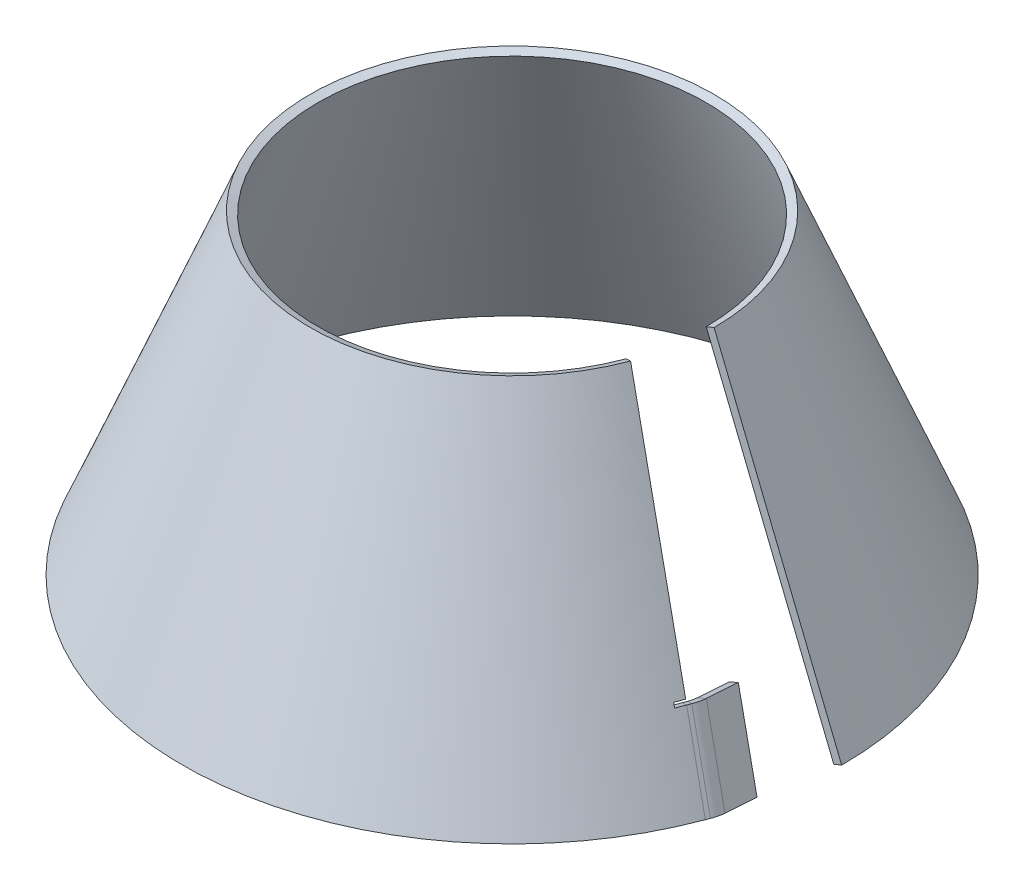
ISO-10303-21;
HEADER;
FILE_DESCRIPTION(('STEP AP214'),'2;1');
FILE_NAME('part.step','',(''),(''),'','','');
FILE_SCHEMA(('AUTOMOTIVE_DESIGN { 1 0 10303 214 1 1 1 1 }'));
ENDSEC;
DATA;
#1=APPLICATION_CONTEXT('core data for automotive mechanical design processes');
#2=APPLICATION_PROTOCOL_DEFINITION('international standard','automotive_design',2000,#1);
#3=PRODUCT_CONTEXT('',#1,'mechanical');
#4=PRODUCT('Part','Part','',(#3));
#5=PRODUCT_RELATED_PRODUCT_CATEGORY('part','',(#4));
#6=PRODUCT_DEFINITION_FORMATION('','',#4);
#7=PRODUCT_DEFINITION_CONTEXT('part definition',#1,'design');
#8=PRODUCT_DEFINITION('design','',#6,#7);
#9=PRODUCT_DEFINITION_SHAPE('','',#8);
#10=(LENGTH_UNIT() NAMED_UNIT(*) SI_UNIT(.MILLI.,.METRE.));
#11=(NAMED_UNIT(*) PLANE_ANGLE_UNIT() SI_UNIT($,.RADIAN.));
#12=(NAMED_UNIT(*) SI_UNIT($,.STERADIAN.) SOLID_ANGLE_UNIT());
#13=UNCERTAINTY_MEASURE_WITH_UNIT(LENGTH_MEASURE(1.E-05),#10,'distance_accuracy_value','');
#14=(GEOMETRIC_REPRESENTATION_CONTEXT(3) GLOBAL_UNCERTAINTY_ASSIGNED_CONTEXT((#13)) GLOBAL_UNIT_ASSIGNED_CONTEXT((#10,
#11,#12)) REPRESENTATION_CONTEXT('',''));
#15=CARTESIAN_POINT('',(0.,0.,0.));
#16=DIRECTION('',(0.,0.,1.));
#17=DIRECTION('',(1.,0.,0.));
#18=AXIS2_PLACEMENT_3D('',#15,#16,#17);
#19=CARTESIAN_POINT('',(5.90430412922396,-0.670239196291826,11.3082897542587));
#20=DIRECTION('',(0.13084470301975,0.187568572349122,0.973497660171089));
#21=DIRECTION('',(0.562327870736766,-0.822744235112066,0.0829414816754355));
#22=AXIS2_PLACEMENT_3D('',#19,#20,#21);
#23=PLANE('',#22);
#24=DIRECTION('',(0.92704443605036,0.324878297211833,-0.187196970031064));
#25=VECTOR('',#24,1.);
#26=CARTESIAN_POINT('',(5.90430412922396,-0.670239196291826,11.3082897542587));
#27=LINE('',#26,#25);
#28=CARTESIAN_POINT('',(31.5918834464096,8.33185035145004,6.12122770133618));
#29=VERTEX_POINT('',#28);
#30=CARTESIAN_POINT('',(32.51892788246,8.65672864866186,5.93403073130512));
#31=VERTEX_POINT('',#30);
#32=EDGE_CURVE('E282',#29,#31,#27,.T.);
#33=ORIENTED_EDGE('',*,*,#32,.T.);
#34=DIRECTION('',(0.351380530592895,-0.926969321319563,0.131375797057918));
#35=VECTOR('',#34,1.);
#36=CARTESIAN_POINT('',(32.51892788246,8.65672864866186,5.93403073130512));
#37=LINE('',#36,#35);
#38=CARTESIAN_POINT('',(36.032733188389,-0.612964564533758,7.2477887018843));
#39=VERTEX_POINT('',#38);
#40=EDGE_CURVE('E281',#31,#39,#37,.T.);
#41=ORIENTED_EDGE('',*,*,#40,.T.);
#42=DIRECTION('',(0.92704443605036,0.324878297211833,-0.187196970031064));
#43=VECTOR('',#42,1.);
#44=CARTESIAN_POINT('',(9.41810943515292,-9.93993240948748,12.6220477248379));
#45=LINE('',#44,#43);
#46=CARTESIAN_POINT('',(35.1056887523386,-0.937842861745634,7.43498567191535));
#47=VERTEX_POINT('',#46);
#48=EDGE_CURVE('E265',#47,#39,#45,.T.);
#49=ORIENTED_EDGE('',*,*,#48,.F.);
#50=DIRECTION('',(0.351380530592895,-0.926969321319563,0.131375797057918));
#51=VECTOR('',#50,1.);
#52=CARTESIAN_POINT('',(31.5918834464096,8.33185035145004,6.12122770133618));
#53=LINE('',#52,#51);
#54=EDGE_CURVE('E14',#29,#47,#53,.T.);
#55=ORIENTED_EDGE('',*,*,#54,.F.);
#56=EDGE_LOOP('',(#33,#41,#49,#55));
#57=FACE_BOUND('',#56,.T.);
#58=ADVANCED_FACE('F64',(#57),#23,.F.);
#59=CARTESIAN_POINT('',(6.55852764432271,0.267603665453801,16.1757780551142));
#60=DIRECTION('',(-0.351380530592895,0.926969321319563,-0.131375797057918));
#61=DIRECTION('',(-0.159317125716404,0.0790750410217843,0.984055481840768));
#62=AXIS2_PLACEMENT_3D('',#59,#60,#61);
#63=PLANE('',#62);
#64=DIRECTION('',(-0.130844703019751,-0.187568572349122,-0.973497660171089));
#65=VECTOR('',#64,1.);
#66=CARTESIAN_POINT('',(33.2082111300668,9.64483035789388,11.062366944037));
#67=LINE('',#66,#65);
#68=CARTESIAN_POINT('',(33.1030319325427,9.49405381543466,10.2798232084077));
#69=VERTEX_POINT('',#68);
#70=EDGE_CURVE('E278',#69,#31,#67,.T.);
#71=ORIENTED_EDGE('',*,*,#70,.T.);
#72=ORIENTED_EDGE('',*,*,#32,.F.);
#73=DIRECTION('',(0.13084470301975,0.187568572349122,0.973497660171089));
#74=VECTOR('',#73,1.);
#75=CARTESIAN_POINT('',(32.2461069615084,9.26969321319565,10.9887160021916));
#76=LINE('',#75,#74);
#77=CARTESIAN_POINT('',(32.1759874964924,9.16917551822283,10.4670201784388));
#78=VERTEX_POINT('',#77);
#79=EDGE_CURVE('E275',#29,#78,#76,.T.);
#80=ORIENTED_EDGE('',*,*,#79,.T.);
#81=DIRECTION('',(0.92704443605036,0.324878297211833,-0.187196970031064));
#82=VECTOR('',#81,1.);
#83=CARTESIAN_POINT('',(6.48840817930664,0.167085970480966,15.6540822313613));
#84=LINE('',#83,#82);
#85=EDGE_CURVE('E200',#78,#69,#84,.T.);
#86=ORIENTED_EDGE('',*,*,#85,.T.);
#87=EDGE_LOOP('',(#71,#72,#80,#86));
#88=FACE_BOUND('',#87,.T.);
#89=ADVANCED_FACE('F250',(#88),#63,.T.);
#90=CARTESIAN_POINT('',(33.2082111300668,9.64483035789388,11.062366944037));
#91=DIRECTION('',(-0.927044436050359,-0.324878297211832,0.187196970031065));
#92=DIRECTION('',(0.330724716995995,-0.943727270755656,0.));
#93=AXIS2_PLACEMENT_3D('',#90,#91,#92);
#94=PLANE('',#93);
#95=ORIENTED_EDGE('',*,*,#70,.F.);
#96=DIRECTION('',(0.351380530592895,-0.926969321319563,0.13137579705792));
#97=VECTOR('',#96,1.);
#98=CARTESIAN_POINT('',(33.1030319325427,9.49405381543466,10.2798232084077));
#99=LINE('',#98,#97);
#100=CARTESIAN_POINT('',(36.6168372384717,0.224360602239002,11.5935811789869));
#101=VERTEX_POINT('',#100);
#102=EDGE_CURVE('E268',#69,#101,#99,.T.);
#103=ORIENTED_EDGE('',*,*,#102,.T.);
#104=DIRECTION('',(0.130844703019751,0.187568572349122,0.973497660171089));
#105=VECTOR('',#104,1.);
#106=CARTESIAN_POINT('',(36.6869567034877,0.324878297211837,12.1152770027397));
#107=LINE('',#106,#105);
#108=EDGE_CURVE('E95',#39,#101,#107,.T.);
#109=ORIENTED_EDGE('',*,*,#108,.F.);
#110=ORIENTED_EDGE('',*,*,#40,.F.);
#111=EDGE_LOOP('',(#95,#103,#109,#110));
#112=FACE_BOUND('',#111,.T.);
#113=ADVANCED_FACE('F254',(#112),#94,.F.);
#114=CARTESIAN_POINT('',(10.0723329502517,-9.00208954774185,17.4895360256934));
#115=DIRECTION('',(-0.351380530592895,0.926969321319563,-0.131375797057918));
#116=DIRECTION('',(-0.159317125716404,0.0790750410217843,0.984055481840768));
#117=AXIS2_PLACEMENT_3D('',#114,#115,#116);
#118=PLANE('',#117);
#119=ORIENTED_EDGE('',*,*,#48,.T.);
#120=ORIENTED_EDGE('',*,*,#108,.T.);
#121=DIRECTION('',(0.92704443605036,0.324878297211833,-0.187196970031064));
#122=VECTOR('',#121,1.);
#123=CARTESIAN_POINT('',(10.0022134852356,-9.10260724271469,16.9678402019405));
#124=LINE('',#123,#122);
#125=CARTESIAN_POINT('',(35.6897928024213,-0.100517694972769,11.780778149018));
#126=VERTEX_POINT('',#125);
#127=EDGE_CURVE('E68',#126,#101,#124,.T.);
#128=ORIENTED_EDGE('',*,*,#127,.F.);
#129=DIRECTION('',(0.13084470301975,0.187568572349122,0.973497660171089));
#130=VECTOR('',#129,1.);
#131=CARTESIAN_POINT('',(35.7599122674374,0.,12.3024739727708));
#132=LINE('',#131,#130);
#133=EDGE_CURVE('E267',#47,#126,#132,.T.);
#134=ORIENTED_EDGE('',*,*,#133,.F.);
#135=EDGE_LOOP('',(#119,#120,#128,#134));
#136=FACE_BOUND('',#135,.T.);
#137=ADVANCED_FACE('F257',(#136),#118,.F.);
#138=CARTESIAN_POINT('',(32.2461069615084,9.26969321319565,10.9887160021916));
#139=DIRECTION('',(0.927044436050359,0.324878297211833,-0.187196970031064));
#140=DIRECTION('',(-0.330724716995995,0.943727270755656,0.));
#141=AXIS2_PLACEMENT_3D('',#138,#139,#140);
#142=PLANE('',#141);
#143=ORIENTED_EDGE('',*,*,#133,.T.);
#144=DIRECTION('',(-0.351380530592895,0.926969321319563,-0.13137579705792));
#145=VECTOR('',#144,1.);
#146=CARTESIAN_POINT('',(32.1759874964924,9.16917551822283,10.4670201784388));
#147=LINE('',#146,#145);
#148=EDGE_CURVE('E74',#126,#78,#147,.T.);
#149=ORIENTED_EDGE('',*,*,#148,.T.);
#150=ORIENTED_EDGE('',*,*,#79,.F.);
#151=ORIENTED_EDGE('',*,*,#54,.T.);
#152=EDGE_LOOP('',(#143,#149,#150,#151));
#153=FACE_BOUND('',#152,.T.);
#154=ADVANCED_FACE('F66',(#153),#142,.F.);
#155=CARTESIAN_POINT('',(14.6201641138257,1.80565890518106,5.46625537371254));
#156=DIRECTION('',(-0.351380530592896,0.926969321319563,-0.131375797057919));
#157=DIRECTION('',(-0.599261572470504,-0.114873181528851,0.792268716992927));
#158=AXIS2_PLACEMENT_3D('',#155,#156,#157);
#159=PLANE('',#158);
#160=DIRECTION('',(0.350207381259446,0.,-0.936672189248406));
#161=VECTOR('',#160,1.);
#162=CARTESIAN_POINT('',(32.7641659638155,9.6448303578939,12.2500196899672));
#163=LINE('',#162,#161);
#164=CARTESIAN_POINT('',(32.7641659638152,9.64483035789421,12.2500196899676));
#165=VERTEX_POINT('',#164);
#166=CARTESIAN_POINT('',(32.9266977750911,9.64483035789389,11.8153086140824));
#167=VERTEX_POINT('',#166);
#168=EDGE_CURVE('E185',#165,#167,#163,.T.);
#169=ORIENTED_EDGE('',*,*,#168,.T.);
#170=DIRECTION('',(0.868266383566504,0.37513714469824,0.32463149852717));
#171=VECTOR('',#170,1.);
#172=CARTESIAN_POINT('',(14.7826959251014,1.80565890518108,5.03154429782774));
#173=LINE('',#172,#171);
#174=CARTESIAN_POINT('',(32.0584313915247,9.26969321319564,11.4906771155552));
#175=VERTEX_POINT('',#174);
#176=EDGE_CURVE('E180',#175,#167,#173,.T.);
#177=ORIENTED_EDGE('',*,*,#176,.F.);
#178=DIRECTION('',(-0.350207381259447,0.,0.936672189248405));
#179=VECTOR('',#178,1.);
#180=CARTESIAN_POINT('',(31.895899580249,9.26969321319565,11.92538819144));
#181=LINE('',#180,#179);
#182=CARTESIAN_POINT('',(31.895899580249,9.26969321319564,11.92538819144));
#183=VERTEX_POINT('',#182);
#184=EDGE_CURVE('E183',#175,#183,#181,.T.);
#185=ORIENTED_EDGE('',*,*,#184,.T.);
#186=CARTESIAN_POINT('',(32.7641659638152,9.64483035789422,12.2500196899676));
#187=CARTESIAN_POINT('',(31.8958995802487,9.26969321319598,11.9253881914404));
#188=B_SPLINE_CURVE_WITH_KNOTS('',1,(#186,#187),.UNSPECIFIED.,.F.,.F.,(2,2),(0.,1.),.UNSPECIFIED.);
#189=EDGE_CURVE('E208',#183,#165,#188,.F.);
#190=ORIENTED_EDGE('',*,*,#189,.T.);
#191=EDGE_LOOP('',(#169,#177,#185,#190));
#192=FACE_BOUND('',#191,.T.);
#193=ADVANCED_FACE('F181',(#192),#159,.T.);
#194=CARTESIAN_POINT('',(18.1339694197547,-7.46403430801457,6.78001334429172));
#195=DIRECTION('',(-0.351380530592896,0.926969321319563,-0.131375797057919));
#196=DIRECTION('',(-0.599261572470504,-0.114873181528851,0.792268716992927));
#197=AXIS2_PLACEMENT_3D('',#194,#195,#196);
#198=PLANE('',#197);
#199=DIRECTION('',(0.868266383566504,0.37513714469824,0.32463149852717));
#200=VECTOR('',#199,1.);
#201=CARTESIAN_POINT('',(18.2965012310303,-7.46403430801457,6.34530226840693));
#202=LINE('',#201,#200);
#203=CARTESIAN_POINT('',(35.5722366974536,0.,12.8044350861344));
#204=VERTEX_POINT('',#203);
#205=CARTESIAN_POINT('',(36.4405030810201,0.375137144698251,13.1290665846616));
#206=VERTEX_POINT('',#205);
#207=EDGE_CURVE('E190',#204,#206,#202,.T.);
#208=ORIENTED_EDGE('',*,*,#207,.T.);
#209=DIRECTION('',(0.350207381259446,0.,-0.936672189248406));
#210=VECTOR('',#209,1.);
#211=CARTESIAN_POINT('',(36.2779712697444,0.375137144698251,13.5637776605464));
#212=LINE('',#211,#210);
#213=CARTESIAN_POINT('',(36.2779712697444,0.375137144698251,13.5637776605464));
#214=VERTEX_POINT('',#213);
#215=EDGE_CURVE('E224',#214,#206,#212,.T.);
#216=ORIENTED_EDGE('',*,*,#215,.F.);
#217=DIRECTION('',(0.868266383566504,0.37513714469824,0.32463149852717));
#218=VECTOR('',#217,1.);
#219=CARTESIAN_POINT('',(18.1339694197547,-7.46403430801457,6.78001334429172));
#220=LINE('',#219,#218);
#221=CARTESIAN_POINT('',(35.4097048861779,0.,13.2391461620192));
#222=VERTEX_POINT('',#221);
#223=EDGE_CURVE('E210',#222,#214,#220,.T.);
#224=ORIENTED_EDGE('',*,*,#223,.F.);
#225=DIRECTION('',(-0.350207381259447,0.,0.936672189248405));
#226=VECTOR('',#225,1.);
#227=CARTESIAN_POINT('',(35.4097048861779,0.,13.2391461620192));
#228=LINE('',#227,#226);
#229=EDGE_CURVE('E110',#204,#222,#228,.T.);
#230=ORIENTED_EDGE('',*,*,#229,.F.);
#231=EDGE_LOOP('',(#208,#216,#224,#230));
#232=FACE_BOUND('',#231,.T.);
#233=ADVANCED_FACE('F246',(#232),#198,.F.);
#234=CARTESIAN_POINT('',(31.895899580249,9.26969321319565,11.92538819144));
#235=DIRECTION('',(0.868266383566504,0.37513714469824,0.32463149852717));
#236=DIRECTION('',(-0.39661773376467,0.917983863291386,0.));
#237=AXIS2_PLACEMENT_3D('',#234,#235,#236);
#238=PLANE('',#237);
#239=DIRECTION('',(-0.351380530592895,0.926969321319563,-0.131375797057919));
#240=VECTOR('',#239,1.);
#241=CARTESIAN_POINT('',(32.0584313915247,9.26969321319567,11.4906771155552));
#242=LINE('',#241,#240);
#243=EDGE_CURVE('E115',#204,#175,#242,.T.);
#244=ORIENTED_EDGE('',*,*,#243,.F.);
#245=ORIENTED_EDGE('',*,*,#229,.T.);
#246=DIRECTION('',(-0.351380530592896,0.926969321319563,-0.131375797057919));
#247=VECTOR('',#246,1.);
#248=CARTESIAN_POINT('',(35.4097048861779,0.,13.2391461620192));
#249=LINE('',#248,#247);
#250=EDGE_CURVE('E194',#222,#183,#249,.T.);
#251=ORIENTED_EDGE('',*,*,#250,.T.);
#252=ORIENTED_EDGE('',*,*,#184,.F.);
#253=EDGE_LOOP('',(#244,#245,#251,#252));
#254=FACE_BOUND('',#253,.T.);
#255=ADVANCED_FACE('F192',(#254),#238,.F.);
#256=CARTESIAN_POINT('',(32.7641659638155,9.6448303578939,12.2500196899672));
#257=DIRECTION('',(-0.868266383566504,-0.37513714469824,-0.324631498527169));
#258=DIRECTION('',(0.396617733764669,-0.917983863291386,0.));
#259=AXIS2_PLACEMENT_3D('',#256,#257,#258);
#260=PLANE('',#259);
#261=DIRECTION('',(0.351380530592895,-0.926969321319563,0.131375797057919));
#262=VECTOR('',#261,1.);
#263=CARTESIAN_POINT('',(32.9266977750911,9.64483035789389,11.8153086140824));
#264=LINE('',#263,#262);
#265=EDGE_CURVE('E643',#167,#206,#264,.T.);
#266=ORIENTED_EDGE('',*,*,#265,.F.);
#267=ORIENTED_EDGE('',*,*,#168,.F.);
#268=DIRECTION('',(-0.351380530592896,0.926969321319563,-0.131375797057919));
#269=VECTOR('',#268,1.);
#270=CARTESIAN_POINT('',(36.2779712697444,0.375137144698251,13.5637776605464));
#271=LINE('',#270,#269);
#272=EDGE_CURVE('E217',#214,#165,#271,.T.);
#273=ORIENTED_EDGE('',*,*,#272,.F.);
#274=ORIENTED_EDGE('',*,*,#215,.T.);
#275=EDGE_LOOP('',(#266,#267,#273,#274));
#276=FACE_BOUND('',#275,.T.);
#277=ADVANCED_FACE('F390',(#276),#260,.F.);
#278=CARTESIAN_POINT('',(32.3664113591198,9.63885541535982,13.2717043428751));
#279=CARTESIAN_POINT('',(32.3078221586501,9.79333964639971,13.2498016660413));
#280=CARTESIAN_POINT('',(32.2492367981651,9.9478238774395,13.2278891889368));
#281=CARTESIAN_POINT('',(32.1906552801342,10.1023081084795,13.2059669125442));
#282=CARTESIAN_POINT('',(31.5087449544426,9.26371827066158,12.9200220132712));
#283=CARTESIAN_POINT('',(31.4501754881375,9.41820250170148,12.8980712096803));
#284=CARTESIAN_POINT('',(31.3916098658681,9.57268673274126,12.8761106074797));
#285=CARTESIAN_POINT('',(31.3330480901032,9.72717096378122,12.8541402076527));
#286=B_SPLINE_SURFACE_WITH_KNOTS('',1,3,((#278,#279,#280,#281),(#282,#283,#284,#285)),
.UNSPECIFIED.,.F.,.F.,.F.,(2,2),(4,4),(0.,1.),(0.,1.),.UNSPECIFIED.);
#287=CARTESIAN_POINT('',(32.1906552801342,10.1023081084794,13.2059669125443));
#288=CARTESIAN_POINT('',(31.3330480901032,9.72717096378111,12.8541402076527));
#289=B_SPLINE_CURVE_WITH_KNOTS('',1,(#287,#288),.UNSPECIFIED.,.F.,.F.,(2,2),(0.,1.),.UNSPECIFIED.);
#290=CARTESIAN_POINT('',(32.1906552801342,10.1023081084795,13.2059669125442));
#291=VERTEX_POINT('',#290);
#292=CARTESIAN_POINT('',(31.3330480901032,9.72717096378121,12.8541402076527));
#293=VERTEX_POINT('',#292);
#294=EDGE_CURVE('E220',#291,#293,#289,.T.);
#295=CARTESIAN_POINT('',(32.1906552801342,10.1023081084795,13.2059669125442));
#296=CARTESIAN_POINT('',(32.2492367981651,9.9478238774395,13.2278891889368));
#297=CARTESIAN_POINT('',(32.3078221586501,9.79333964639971,13.2498016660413));
#298=CARTESIAN_POINT('',(32.3664113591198,9.63885541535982,13.2717043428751));
#299=B_SPLINE_CURVE_WITH_KNOTS('',3,(#295,#296,#297,#298),.UNSPECIFIED.,.F.,.F.,(4,4),(0.,1.),.UNSPECIFIED.);
#300=CARTESIAN_POINT('',(32.3664113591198,9.63885541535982,13.2717043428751));
#301=VERTEX_POINT('',#300);
#302=EDGE_CURVE('E292',#301,#291,#299,.F.);
#303=CARTESIAN_POINT('',(32.3664113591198,9.63885541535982,13.2717043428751));
#304=CARTESIAN_POINT('',(31.5087449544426,9.26371827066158,12.9200220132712));
#305=B_SPLINE_CURVE_WITH_KNOTS('',1,(#303,#304),.UNSPECIFIED.,.F.,.F.,(2,2),(0.,1.),.UNSPECIFIED.);
#306=CARTESIAN_POINT('',(31.5087449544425,9.26371827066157,12.9200220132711));
#307=VERTEX_POINT('',#306);
#308=EDGE_CURVE('E425',#301,#307,#305,.T.);
#309=CARTESIAN_POINT('',(31.5087449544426,9.26371827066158,12.9200220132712));
#310=CARTESIAN_POINT('',(31.4501754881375,9.41820250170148,12.8980712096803));
#311=CARTESIAN_POINT('',(31.3916098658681,9.57268673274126,12.8761106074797));
#312=CARTESIAN_POINT('',(31.3330480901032,9.72717096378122,12.8541402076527));
#313=B_SPLINE_CURVE_WITH_KNOTS('',3,(#309,#310,#311,#312),.UNSPECIFIED.,.F.,.F.,(4,4),(0.,1.),.UNSPECIFIED.);
#314=EDGE_CURVE('E370',#307,#293,#313,.T.);
#315=ORIENTED_EDGE('',*,*,#294,.F.);
#316=ORIENTED_EDGE('',*,*,#302,.F.);
#317=ORIENTED_EDGE('',*,*,#308,.T.);
#318=ORIENTED_EDGE('',*,*,#314,.T.);
#319=EDGE_LOOP('',(#315,#316,#317,#318));
#320=FACE_BOUND('',#319,.T.);
#321=ADVANCED_FACE('F377',(#320),#286,.T.);
#322=CARTESIAN_POINT('',(32.7641659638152,9.64483035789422,12.2500196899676));
#323=CARTESIAN_POINT('',(32.6344798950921,9.64553801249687,12.5960630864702));
#324=CARTESIAN_POINT('',(32.5017667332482,9.64354635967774,12.9366021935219));
#325=CARTESIAN_POINT('',(32.3664113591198,9.63885541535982,13.2717043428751));
#326=CARTESIAN_POINT('',(31.8958995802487,9.26969321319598,11.9253881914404));
#327=CARTESIAN_POINT('',(31.7696431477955,9.27040086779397,12.2622586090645));
#328=CARTESIAN_POINT('',(31.6404670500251,9.26840921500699,12.5937805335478));
#329=CARTESIAN_POINT('',(31.5087449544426,9.26371827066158,12.9200220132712));
#330=B_SPLINE_SURFACE_WITH_KNOTS('',1,3,((#322,#323,#324,#325),(#326,#327,#328,#329)),
.UNSPECIFIED.,.F.,.F.,.F.,(2,2),(4,4),(0.,1.),(0.,1.),.UNSPECIFIED.);
#331=CARTESIAN_POINT('',(32.3664113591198,9.63885541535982,13.2717043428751));
#332=CARTESIAN_POINT('',(32.5017667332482,9.64354635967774,12.9366021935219));
#333=CARTESIAN_POINT('',(32.6344798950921,9.64553801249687,12.5960630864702));
#334=CARTESIAN_POINT('',(32.7641659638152,9.64483035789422,12.2500196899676));
#335=B_SPLINE_CURVE_WITH_KNOTS('',3,(#331,#332,#333,#334),.UNSPECIFIED.,.F.,.F.,(4,4),(0.,1.),.UNSPECIFIED.);
#336=EDGE_CURVE('E306',#165,#301,#335,.F.);
#337=CARTESIAN_POINT('',(31.8958995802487,9.26969321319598,11.9253881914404));
#338=CARTESIAN_POINT('',(31.7696431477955,9.27040086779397,12.2622586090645));
#339=CARTESIAN_POINT('',(31.6404670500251,9.26840921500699,12.5937805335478));
#340=CARTESIAN_POINT('',(31.5087449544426,9.26371827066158,12.9200220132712));
#341=B_SPLINE_CURVE_WITH_KNOTS('',3,(#337,#338,#339,#340),.UNSPECIFIED.,.F.,.F.,(4,4),(0.,1.),.UNSPECIFIED.);
#342=EDGE_CURVE('E317',#183,#307,#341,.T.);
#343=ORIENTED_EDGE('',*,*,#308,.F.);
#344=ORIENTED_EDGE('',*,*,#336,.F.);
#345=ORIENTED_EDGE('',*,*,#189,.F.);
#346=ORIENTED_EDGE('',*,*,#342,.T.);
#347=EDGE_LOOP('',(#343,#344,#345,#346));
#348=FACE_BOUND('',#347,.T.);
#349=ADVANCED_FACE('F389',(#348),#330,.T.);
#350=CARTESIAN_POINT('',(0.,0.187568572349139,0.));
#351=DIRECTION('',(0.,1.,0.));
#352=DIRECTION('',(0.,0.,1.));
#353=AXIS2_PLACEMENT_3D('',#350,#351,#352);
#354=CONICAL_SURFACE('',#353,38.2672171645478,1.186251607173);
#355=ORIENTED_EDGE('',*,*,#223,.T.);
#356=CARTESIAN_POINT('',(0.,0.375137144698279,0.));
#357=DIRECTION('',(0.,-1.,0.));
#358=DIRECTION('',(0.,0.,-1.));
#359=AXIS2_PLACEMENT_3D('',#356,#357,#358);
#360=CIRCLE('',#359,38.7307018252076);
#361=CARTESIAN_POINT('',(38.7307018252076,0.375137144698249,0.));
#362=VERTEX_POINT('',#361);
#363=EDGE_CURVE('E303',#214,#362,#360,.T.);
#364=ORIENTED_EDGE('',*,*,#363,.T.);
#365=DIRECTION('',(-0.926969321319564,-0.375137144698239,0.));
#366=VECTOR('',#365,1.);
#367=CARTESIAN_POINT('',(38.2672171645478,0.187568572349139,0.));
#368=LINE('',#367,#366);
#369=CARTESIAN_POINT('',(37.803732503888,0.,0.));
#370=VERTEX_POINT('',#369);
#371=EDGE_CURVE('E494',#362,#370,#368,.T.);
#372=ORIENTED_EDGE('',*,*,#371,.T.);
#373=CARTESIAN_POINT('',(0.,0.,0.));
#374=DIRECTION('',(0.,-1.,0.));
#375=DIRECTION('',(0.,0.,-1.));
#376=AXIS2_PLACEMENT_3D('',#373,#374,#375);
#377=CIRCLE('',#376,37.803732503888);
#378=EDGE_CURVE('E314',#222,#370,#377,.T.);
#379=ORIENTED_EDGE('',*,*,#378,.F.);
#380=EDGE_LOOP('',(#355,#364,#372,#379));
#381=FACE_BOUND('',#380,.T.);
#382=ADVANCED_FACE('F478',(#381),#354,.T.);
#383=CARTESIAN_POINT('',(38.2672171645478,0.187568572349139,0.));
#384=DIRECTION('',(0.,0.,-1.));
#385=DIRECTION('',(-0.37513714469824,0.926969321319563,0.));
#386=AXIS2_PLACEMENT_3D('',#383,#384,#385);
#387=PLANE('',#386);
#388=ORIENTED_EDGE('',*,*,#371,.F.);
#389=DIRECTION('',(0.375137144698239,-0.926969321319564,0.));
#390=VECTOR('',#389,1.);
#391=CARTESIAN_POINT('',(271.491520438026,-574.780218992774,0.));
#392=LINE('',#391,#390);
#393=CARTESIAN_POINT('',(23.7395665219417,37.4184497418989,0.));
#394=VERTEX_POINT('',#393);
#395=EDGE_CURVE('E300',#362,#394,#392,.F.);
#396=ORIENTED_EDGE('',*,*,#395,.T.);
#397=DIRECTION('',(-0.926969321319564,-0.375137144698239,0.));
#398=VECTOR('',#397,1.);
#399=CARTESIAN_POINT('',(23.2760818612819,37.2308811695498,0.));
#400=LINE('',#399,#398);
#401=CARTESIAN_POINT('',(22.8125972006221,37.0433125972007,0.));
#402=VERTEX_POINT('',#401);
#403=EDGE_CURVE('E493',#394,#402,#400,.T.);
#404=ORIENTED_EDGE('',*,*,#403,.T.);
#405=DIRECTION('',(0.375137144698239,-0.926969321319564,0.));
#406=VECTOR('',#405,1.);
#407=CARTESIAN_POINT('',(270.564551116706,-575.155356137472,0.));
#408=LINE('',#407,#406);
#409=EDGE_CURVE('E311',#370,#402,#408,.F.);
#410=ORIENTED_EDGE('',*,*,#409,.F.);
#411=EDGE_LOOP('',(#388,#396,#404,#410));
#412=FACE_BOUND('',#411,.T.);
#413=ADVANCED_FACE('F475',(#412),#387,.F.);
#414=CARTESIAN_POINT('',(0.,37.2308811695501,0.));
#415=DIRECTION('',(0.,1.,0.));
#416=DIRECTION('',(0.,0.,1.));
#417=AXIS2_PLACEMENT_3D('',#414,#415,#416);
#418=CONICAL_SURFACE('',#417,23.2760818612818,1.186251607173);
#419=ORIENTED_EDGE('',*,*,#403,.F.);
#420=CARTESIAN_POINT('',(0.,37.4184497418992,0.));
#421=DIRECTION('',(0.,-1.,0.));
#422=DIRECTION('',(0.,0.,-1.));
#423=AXIS2_PLACEMENT_3D('',#420,#421,#422);
#424=CIRCLE('',#423,23.7395665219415);
#425=CARTESIAN_POINT('',(22.236191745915,37.4184497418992,8.31377142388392));
#426=VERTEX_POINT('',#425);
#427=EDGE_CURVE('E296',#426,#394,#424,.T.);
#428=ORIENTED_EDGE('',*,*,#427,.F.);
#429=DIRECTION('',(-0.868266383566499,-0.375137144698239,-0.324631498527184));
#430=VECTOR('',#429,1.);
#431=CARTESIAN_POINT('',(21.8020585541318,37.2308811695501,8.15145567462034));
#432=LINE('',#431,#430);
#433=CARTESIAN_POINT('',(21.3679253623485,37.043312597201,7.98913992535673));
#434=VERTEX_POINT('',#433);
#435=EDGE_CURVE('E496',#426,#434,#432,.T.);
#436=ORIENTED_EDGE('',*,*,#435,.T.);
#437=CARTESIAN_POINT('',(0.,37.043312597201,0.));
#438=DIRECTION('',(0.,-1.,0.));
#439=DIRECTION('',(0.,0.,-1.));
#440=AXIS2_PLACEMENT_3D('',#437,#438,#439);
#441=CIRCLE('',#440,22.812597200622);
#442=EDGE_CURVE('E307',#434,#402,#441,.T.);
#443=ORIENTED_EDGE('',*,*,#442,.T.);
#444=EDGE_LOOP('',(#419,#428,#436,#443));
#445=FACE_BOUND('',#444,.T.);
#446=ADVANCED_FACE('F472',(#445),#418,.F.);
#447=CARTESIAN_POINT('',(32.1543425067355,9.92074644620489,12.022016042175));
#448=DIRECTION('',(0.350207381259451,0.,-0.936672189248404));
#449=DIRECTION('',(-0.351380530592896,0.926969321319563,-0.131375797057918));
#450=AXIS2_PLACEMENT_3D('',#447,#448,#449);
#451=PLANE('',#450);
#452=ORIENTED_EDGE('',*,*,#435,.F.);
#453=DIRECTION('',(0.351380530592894,-0.926969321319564,0.131375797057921));
#454=VECTOR('',#453,1.);
#455=CARTESIAN_POINT('',(254.298556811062,-574.780218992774,95.0783344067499));
#456=LINE('',#455,#454);
#457=CARTESIAN_POINT('',(32.5884756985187,10.108315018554,12.1843317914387));
#458=VERTEX_POINT('',#457);
#459=EDGE_CURVE('E299',#458,#426,#456,.F.);
#460=ORIENTED_EDGE('',*,*,#459,.F.);
#461=CARTESIAN_POINT('',(31.7202093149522,9.7331778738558,11.8597002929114));
#462=CARTESIAN_POINT('',(32.5884756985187,10.108315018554,12.1843317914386));
#463=B_SPLINE_CURVE_WITH_KNOTS('',1,(#461,#462),.UNSPECIFIED.,.F.,.F.,(2,2),(0.,1.),.UNSPECIFIED.);
#464=CARTESIAN_POINT('',(31.7202093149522,9.73317787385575,11.8597002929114));
#465=VERTEX_POINT('',#464);
#466=EDGE_CURVE('E457',#458,#465,#463,.F.);
#467=ORIENTED_EDGE('',*,*,#466,.T.);
#468=DIRECTION('',(0.351380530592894,-0.926969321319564,0.131375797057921));
#469=VECTOR('',#468,1.);
#470=CARTESIAN_POINT('',(253.430290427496,-575.155356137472,94.7537029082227));
#471=LINE('',#470,#469);
#472=EDGE_CURVE('E310',#465,#434,#471,.F.);
#473=ORIENTED_EDGE('',*,*,#472,.T.);
#474=EDGE_LOOP('',(#452,#460,#467,#473));
#475=FACE_BOUND('',#474,.T.);
#476=ADVANCED_FACE('F463',(#475),#451,.T.);
#477=CARTESIAN_POINT('',(32.5884756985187,10.108315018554,12.1843317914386));
#478=CARTESIAN_POINT('',(32.4587906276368,10.1090263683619,12.5303682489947));
#479=CARTESIAN_POINT('',(32.326054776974,10.1070240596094,12.8708908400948));
#480=CARTESIAN_POINT('',(32.1906552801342,10.1023081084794,13.2059669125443));
#481=CARTESIAN_POINT('',(31.7202093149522,9.7331778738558,11.8597002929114));
#482=CARTESIAN_POINT('',(31.5939723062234,9.73388922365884,12.1965144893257));
#483=CARTESIAN_POINT('',(31.4647933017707,9.73188691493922,12.527971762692));
#484=CARTESIAN_POINT('',(31.3330480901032,9.72717096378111,12.8541402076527));
#485=B_SPLINE_SURFACE_WITH_KNOTS('',1,3,((#477,#478,#479,#480),(#481,#482,#483,#484)),
.UNSPECIFIED.,.F.,.F.,.F.,(2,2),(4,4),(0.,1.),(0.,1.),.UNSPECIFIED.);
#486=CARTESIAN_POINT('',(32.5884756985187,10.108315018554,12.1843317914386));
#487=CARTESIAN_POINT('',(32.4587906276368,10.1090263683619,12.5303682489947));
#488=CARTESIAN_POINT('',(32.326054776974,10.1070240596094,12.8708908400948));
#489=CARTESIAN_POINT('',(32.1906552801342,10.1023081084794,13.2059669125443));
#490=B_SPLINE_CURVE_WITH_KNOTS('',3,(#486,#487,#488,#489),.UNSPECIFIED.,.F.,.F.,(4,4),(0.,1.),.UNSPECIFIED.);
#491=EDGE_CURVE('E510',#458,#291,#490,.T.);
#492=CARTESIAN_POINT('',(31.3330480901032,9.72717096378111,12.8541402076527));
#493=CARTESIAN_POINT('',(31.4647933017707,9.73188691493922,12.527971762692));
#494=CARTESIAN_POINT('',(31.5939723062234,9.73388922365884,12.1965144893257));
#495=CARTESIAN_POINT('',(31.7202093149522,9.7331778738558,11.8597002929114));
#496=B_SPLINE_CURVE_WITH_KNOTS('',3,(#492,#493,#494,#495),.UNSPECIFIED.,.F.,.F.,(4,4),(0.,1.),.UNSPECIFIED.);
#497=EDGE_CURVE('E520',#465,#293,#496,.F.);
#498=ORIENTED_EDGE('',*,*,#491,.T.);
#499=ORIENTED_EDGE('',*,*,#294,.T.);
#500=ORIENTED_EDGE('',*,*,#497,.F.);
#501=ORIENTED_EDGE('',*,*,#466,.F.);
#502=EDGE_LOOP('',(#498,#499,#500,#501));
#503=FACE_BOUND('',#502,.T.);
#504=ADVANCED_FACE('F337',(#503),#485,.F.);
#505=CARTESIAN_POINT('',(0.,-575.155356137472,0.));
#506=DIRECTION('',(0.,-1.,0.));
#507=DIRECTION('',(0.,0.,-1.));
#508=AXIS2_PLACEMENT_3D('',#505,#506,#507);
#509=CONICAL_SURFACE('',#508,270.564551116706,0.384544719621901);
#510=ORIENTED_EDGE('',*,*,#472,.F.);
#511=ORIENTED_EDGE('',*,*,#497,.T.);
#512=ORIENTED_EDGE('',*,*,#314,.F.);
#513=ORIENTED_EDGE('',*,*,#342,.F.);
#514=ORIENTED_EDGE('',*,*,#250,.F.);
#515=ORIENTED_EDGE('',*,*,#378,.T.);
#516=ORIENTED_EDGE('',*,*,#409,.T.);
#517=ORIENTED_EDGE('',*,*,#442,.F.);
#518=EDGE_LOOP('',(#510,#511,#512,#513,#514,#515,#516,#517));
#519=FACE_BOUND('',#518,.T.);
#520=ADVANCED_FACE('F335',(#519),#509,.F.);
#521=CARTESIAN_POINT('',(0.,-574.780218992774,0.));
#522=DIRECTION('',(0.,-1.,0.));
#523=DIRECTION('',(0.,0.,-1.));
#524=AXIS2_PLACEMENT_3D('',#521,#522,#523);
#525=CONICAL_SURFACE('',#524,271.491520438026,0.384544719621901);
#526=ORIENTED_EDGE('',*,*,#459,.T.);
#527=ORIENTED_EDGE('',*,*,#427,.T.);
#528=ORIENTED_EDGE('',*,*,#395,.F.);
#529=ORIENTED_EDGE('',*,*,#363,.F.);
#530=ORIENTED_EDGE('',*,*,#272,.T.);
#531=ORIENTED_EDGE('',*,*,#336,.T.);
#532=ORIENTED_EDGE('',*,*,#302,.T.);
#533=ORIENTED_EDGE('',*,*,#491,.F.);
#534=EDGE_LOOP('',(#526,#527,#528,#529,#530,#531,#532,#533));
#535=FACE_BOUND('',#534,.T.);
#536=ADVANCED_FACE('F325',(#535),#525,.T.);
#537=CARTESIAN_POINT('',(30.3218986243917,8.51941892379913,10.8414141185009));
#538=DIRECTION('',(-0.351380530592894,0.926969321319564,-0.13137579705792));
#539=DIRECTION('',(-0.935073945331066,-0.354452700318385,0.));
#540=AXIS2_PLACEMENT_3D('',#537,#538,#539);
#541=PLANE('',#540);
#542=ORIENTED_EDGE('',*,*,#85,.F.);
#543=CARTESIAN_POINT('',(30.3218986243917,8.51941892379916,10.8414141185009));
#544=DIRECTION('',(0.351380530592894,-0.926969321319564,0.13137579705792));
#545=DIRECTION('',(0.935073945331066,0.354452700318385,0.));
#546=AXIS2_PLACEMENT_3D('',#543,#544,#545);
#547=CIRCLE('',#546,2.);
#548=EDGE_CURVE('E197',#78,#175,#547,.T.);
#549=ORIENTED_EDGE('',*,*,#548,.T.);
#550=ORIENTED_EDGE('',*,*,#176,.T.);
#551=CARTESIAN_POINT('',(30.3218986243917,8.51941892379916,10.8414141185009));
#552=DIRECTION('',(0.351380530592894,-0.926969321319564,0.13137579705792));
#553=DIRECTION('',(0.935073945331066,0.354452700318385,0.));
#554=AXIS2_PLACEMENT_3D('',#551,#552,#553);
#555=CIRCLE('',#554,3.);
#556=EDGE_CURVE('E290',#69,#167,#555,.T.);
#557=ORIENTED_EDGE('',*,*,#556,.F.);
#558=EDGE_LOOP('',(#542,#549,#550,#557));
#559=FACE_BOUND('',#558,.T.);
#560=ADVANCED_FACE('F198',(#559),#541,.T.);
#561=CARTESIAN_POINT('',(33.8357039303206,-0.750274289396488,12.1551720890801));
#562=DIRECTION('',(0.351380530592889,-0.926969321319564,0.131375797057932));
#563=DIRECTION('',(0.935073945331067,0.354452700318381,0.));
#564=AXIS2_PLACEMENT_3D('',#561,#562,#563);
#565=PLANE('',#564);
#566=CARTESIAN_POINT('',(33.8357039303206,-0.75027428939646,12.1551720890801));
#567=DIRECTION('',(0.351380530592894,-0.926969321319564,0.13137579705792));
#568=DIRECTION('',(0.935073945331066,0.354452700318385,0.));
#569=AXIS2_PLACEMENT_3D('',#566,#567,#568);
#570=CIRCLE('',#569,2.);
#571=EDGE_CURVE('E203',#204,#126,#570,.F.);
#572=ORIENTED_EDGE('',*,*,#571,.T.);
#573=ORIENTED_EDGE('',*,*,#127,.T.);
#574=CARTESIAN_POINT('',(33.8357039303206,-0.75027428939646,12.1551720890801));
#575=DIRECTION('',(0.351380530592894,-0.926969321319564,0.13137579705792));
#576=DIRECTION('',(0.935073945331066,0.354452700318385,0.));
#577=AXIS2_PLACEMENT_3D('',#574,#575,#576);
#578=CIRCLE('',#577,3.);
#579=EDGE_CURVE('E102',#206,#101,#578,.F.);
#580=ORIENTED_EDGE('',*,*,#579,.F.);
#581=ORIENTED_EDGE('',*,*,#207,.F.);
#582=EDGE_LOOP('',(#572,#573,#580,#581));
#583=FACE_BOUND('',#582,.T.);
#584=ADVANCED_FACE('F286',(#583),#565,.T.);
#585=CARTESIAN_POINT('',(-10.35437394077,115.826607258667,-4.36682101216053));
#586=DIRECTION('',(0.351380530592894,-0.926969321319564,0.13137579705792));
#587=DIRECTION('',(0.935073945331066,0.354452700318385,0.));
#588=AXIS2_PLACEMENT_3D('',#585,#586,#587);
#589=CYLINDRICAL_SURFACE('',#588,3.);
#590=ORIENTED_EDGE('',*,*,#265,.T.);
#591=ORIENTED_EDGE('',*,*,#579,.T.);
#592=ORIENTED_EDGE('',*,*,#102,.F.);
#593=ORIENTED_EDGE('',*,*,#556,.T.);
#594=EDGE_LOOP('',(#590,#591,#592,#593));
#595=FACE_BOUND('',#594,.T.);
#596=ADVANCED_FACE('F289',(#595),#589,.T.);
#597=CARTESIAN_POINT('',(-10.35437394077,115.826607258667,-4.36682101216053));
#598=DIRECTION('',(0.351380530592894,-0.926969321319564,0.13137579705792));
#599=DIRECTION('',(0.935073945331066,0.354452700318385,0.));
#600=AXIS2_PLACEMENT_3D('',#597,#598,#599);
#601=CYLINDRICAL_SURFACE('',#600,2.);
#602=ORIENTED_EDGE('',*,*,#243,.T.);
#603=ORIENTED_EDGE('',*,*,#548,.F.);
#604=ORIENTED_EDGE('',*,*,#148,.F.);
#605=ORIENTED_EDGE('',*,*,#571,.F.);
#606=EDGE_LOOP('',(#602,#603,#604,#605));
#607=FACE_BOUND('',#606,.T.);
#608=ADVANCED_FACE('F206',(#607),#601,.F.);
#609=CLOSED_SHELL('',(#58,#89,#113,#137,#154,#193,#233,#255,#277,#321,#349,#382,#413,#446,#476,
#504,#520,#536,#560,#584,#596,#608));
#610=MANIFOLD_SOLID_BREP('B2',#609);
#611=ADVANCED_BREP_SHAPE_REPRESENTATION('',(#18,#610),#14);
#612=SHAPE_DEFINITION_REPRESENTATION(#9,#611);
ENDSEC;
END-ISO-10303-21;
